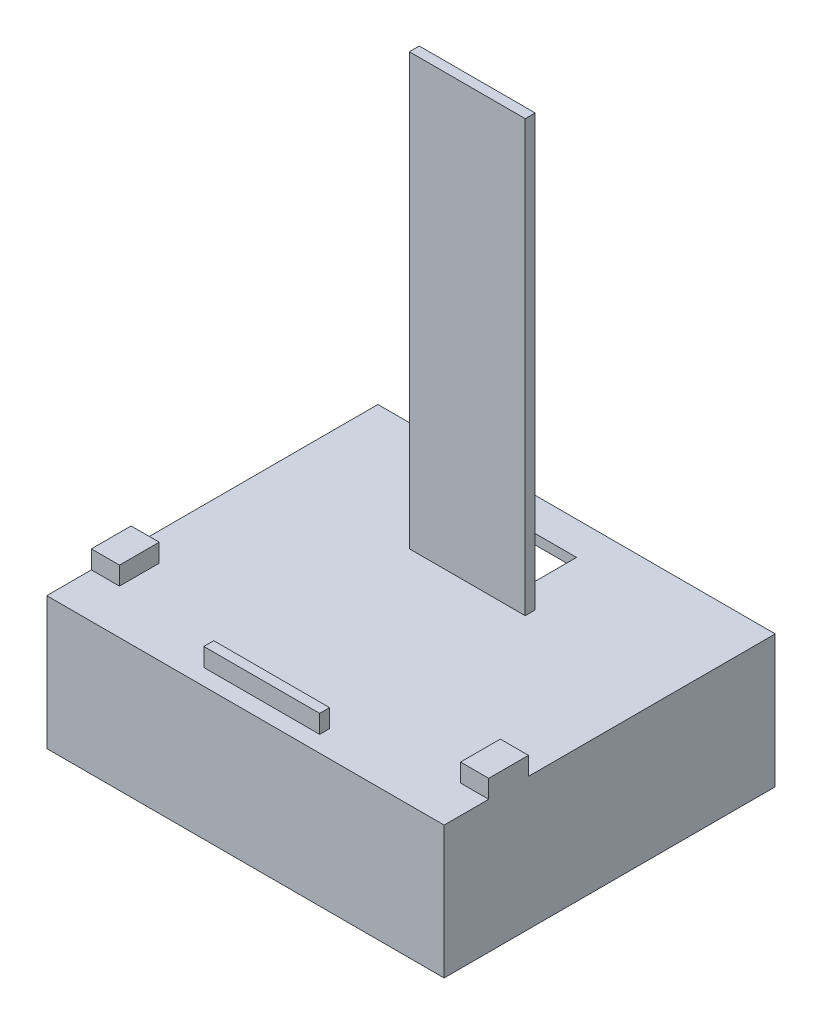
ISO-10303-21;
HEADER;
FILE_DESCRIPTION(('STEP AP214'),'2;1');
FILE_NAME('part.step','',(''),(''),'','','');
FILE_SCHEMA(('AUTOMOTIVE_DESIGN { 1 0 10303 214 1 1 1 1 }'));
ENDSEC;
DATA;
#1=APPLICATION_CONTEXT('core data for automotive mechanical design processes');
#2=APPLICATION_PROTOCOL_DEFINITION('international standard','automotive_design',2000,#1);
#3=PRODUCT_CONTEXT('',#1,'mechanical');
#4=PRODUCT('Part','Part','',(#3));
#5=PRODUCT_RELATED_PRODUCT_CATEGORY('part','',(#4));
#6=PRODUCT_DEFINITION_FORMATION('','',#4);
#7=PRODUCT_DEFINITION_CONTEXT('part definition',#1,'design');
#8=PRODUCT_DEFINITION('design','',#6,#7);
#9=PRODUCT_DEFINITION_SHAPE('','',#8);
#10=(LENGTH_UNIT() NAMED_UNIT(*) SI_UNIT(.MILLI.,.METRE.));
#11=(NAMED_UNIT(*) PLANE_ANGLE_UNIT() SI_UNIT($,.RADIAN.));
#12=(NAMED_UNIT(*) SI_UNIT($,.STERADIAN.) SOLID_ANGLE_UNIT());
#13=UNCERTAINTY_MEASURE_WITH_UNIT(LENGTH_MEASURE(1.E-05),#10,'distance_accuracy_value','');
#14=(GEOMETRIC_REPRESENTATION_CONTEXT(3) GLOBAL_UNCERTAINTY_ASSIGNED_CONTEXT((#13)) GLOBAL_UNIT_ASSIGNED_CONTEXT((#10,
#11,#12)) REPRESENTATION_CONTEXT('',''));
#15=CARTESIAN_POINT('',(0.,0.,0.));
#16=DIRECTION('',(0.,0.,1.));
#17=DIRECTION('',(1.,0.,0.));
#18=AXIS2_PLACEMENT_3D('',#15,#16,#17);
#19=CARTESIAN_POINT('',(0.,40.,0.));
#20=DIRECTION('',(0.,-1.,0.));
#21=DIRECTION('',(0.,0.,-1.));
#22=AXIS2_PLACEMENT_3D('',#19,#20,#21);
#23=PLANE('',#22);
#24=DIRECTION('',(-1.,0.,0.));
#25=VECTOR('',#24,1.);
#26=CARTESIAN_POINT('',(-51.5,40.,24.5331363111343));
#27=LINE('',#26,#25);
#28=CARTESIAN_POINT('',(-51.5,40.,24.5331363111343));
#29=VERTEX_POINT('',#28);
#30=CARTESIAN_POINT('',(-60.,40.,24.5331363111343));
#31=VERTEX_POINT('',#30);
#32=EDGE_CURVE('E281',#29,#31,#27,.T.);
#33=ORIENTED_EDGE('',*,*,#32,.F.);
#34=DIRECTION('',(0.,0.,-1.));
#35=VECTOR('',#34,1.);
#36=CARTESIAN_POINT('',(-51.5,40.,36.5331363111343));
#37=LINE('',#36,#35);
#38=CARTESIAN_POINT('',(-51.5,40.,36.5331363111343));
#39=VERTEX_POINT('',#38);
#40=EDGE_CURVE('E285',#39,#29,#37,.T.);
#41=ORIENTED_EDGE('',*,*,#40,.F.);
#42=DIRECTION('',(1.,0.,0.));
#43=VECTOR('',#42,1.);
#44=CARTESIAN_POINT('',(-60.,40.,36.5331363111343));
#45=LINE('',#44,#43);
#46=CARTESIAN_POINT('',(-60.,40.,36.5331363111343));
#47=VERTEX_POINT('',#46);
#48=EDGE_CURVE('E278',#47,#39,#45,.T.);
#49=ORIENTED_EDGE('',*,*,#48,.F.);
#50=DIRECTION('',(0.,0.,1.));
#51=VECTOR('',#50,1.);
#52=CARTESIAN_POINT('',(-60.,40.,50.));
#53=LINE('',#52,#51);
#54=CARTESIAN_POINT('',(-60.,40.,50.));
#55=VERTEX_POINT('',#54);
#56=EDGE_CURVE('E430',#47,#55,#53,.T.);
#57=ORIENTED_EDGE('',*,*,#56,.T.);
#58=DIRECTION('',(1.,0.,0.));
#59=VECTOR('',#58,1.);
#60=CARTESIAN_POINT('',(-60.,40.,50.));
#61=LINE('',#60,#59);
#62=CARTESIAN_POINT('',(60.,40.,50.));
#63=VERTEX_POINT('',#62);
#64=EDGE_CURVE('E433',#55,#63,#61,.T.);
#65=ORIENTED_EDGE('',*,*,#64,.T.);
#66=DIRECTION('',(0.,0.,-1.));
#67=VECTOR('',#66,1.);
#68=CARTESIAN_POINT('',(60.,40.,50.));
#69=LINE('',#68,#67);
#70=CARTESIAN_POINT('',(60.,40.,36.5331363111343));
#71=VERTEX_POINT('',#70);
#72=EDGE_CURVE('E425',#63,#71,#69,.T.);
#73=ORIENTED_EDGE('',*,*,#72,.T.);
#74=DIRECTION('',(1.,0.,0.));
#75=VECTOR('',#74,1.);
#76=CARTESIAN_POINT('',(60.,40.,36.5331363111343));
#77=LINE('',#76,#75);
#78=CARTESIAN_POINT('',(51.5,40.,36.5331363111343));
#79=VERTEX_POINT('',#78);
#80=EDGE_CURVE('E308',#79,#71,#77,.T.);
#81=ORIENTED_EDGE('',*,*,#80,.F.);
#82=DIRECTION('',(0.,0.,1.));
#83=VECTOR('',#82,1.);
#84=CARTESIAN_POINT('',(51.5,40.,36.5331363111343));
#85=LINE('',#84,#83);
#86=CARTESIAN_POINT('',(51.5,40.,24.5331363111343));
#87=VERTEX_POINT('',#86);
#88=EDGE_CURVE('E311',#87,#79,#85,.T.);
#89=ORIENTED_EDGE('',*,*,#88,.F.);
#90=DIRECTION('',(-1.,0.,0.));
#91=VECTOR('',#90,1.);
#92=CARTESIAN_POINT('',(51.5,40.,24.5331363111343));
#93=LINE('',#92,#91);
#94=CARTESIAN_POINT('',(60.,40.,24.5331363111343));
#95=VERTEX_POINT('',#94);
#96=EDGE_CURVE('E315',#95,#87,#93,.T.);
#97=ORIENTED_EDGE('',*,*,#96,.F.);
#98=CARTESIAN_POINT('',(60.,40.,-50.));
#99=VERTEX_POINT('',#98);
#100=EDGE_CURVE('E428',#95,#99,#69,.T.);
#101=ORIENTED_EDGE('',*,*,#100,.T.);
#102=DIRECTION('',(-1.,0.,0.));
#103=VECTOR('',#102,1.);
#104=CARTESIAN_POINT('',(-60.,40.,-50.));
#105=LINE('',#104,#103);
#106=CARTESIAN_POINT('',(-60.,40.,-50.));
#107=VERTEX_POINT('',#106);
#108=EDGE_CURVE('E427',#99,#107,#105,.T.);
#109=ORIENTED_EDGE('',*,*,#108,.T.);
#110=EDGE_CURVE('E431',#107,#31,#53,.T.);
#111=ORIENTED_EDGE('',*,*,#110,.T.);
#112=EDGE_LOOP('',(#33,#41,#49,#57,#65,#73,#81,#89,#97,#101,#109,#111));
#113=FACE_BOUND('',#112,.T.);
#114=DIRECTION('',(0.,0.,-1.));
#115=VECTOR('',#114,1.);
#116=CARTESIAN_POINT('',(17.5,40.,45.0733400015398));
#117=LINE('',#116,#115);
#118=CARTESIAN_POINT('',(17.5,40.,45.0733400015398));
#119=VERTEX_POINT('',#118);
#120=CARTESIAN_POINT('',(17.5,40.,42.0733400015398));
#121=VERTEX_POINT('',#120);
#122=EDGE_CURVE('E318',#119,#121,#117,.T.);
#123=ORIENTED_EDGE('',*,*,#122,.F.);
#124=DIRECTION('',(1.,0.,0.));
#125=VECTOR('',#124,1.);
#126=CARTESIAN_POINT('',(-17.5,40.,45.0733400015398));
#127=LINE('',#126,#125);
#128=CARTESIAN_POINT('',(-17.5,40.,45.0733400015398));
#129=VERTEX_POINT('',#128);
#130=EDGE_CURVE('E330',#129,#119,#127,.T.);
#131=ORIENTED_EDGE('',*,*,#130,.F.);
#132=DIRECTION('',(0.,0.,1.));
#133=VECTOR('',#132,1.);
#134=CARTESIAN_POINT('',(-17.5,40.,45.0733400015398));
#135=LINE('',#134,#133);
#136=CARTESIAN_POINT('',(-17.5,40.,42.0733400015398));
#137=VERTEX_POINT('',#136);
#138=EDGE_CURVE('E342',#137,#129,#135,.T.);
#139=ORIENTED_EDGE('',*,*,#138,.F.);
#140=DIRECTION('',(-1.,0.,0.));
#141=VECTOR('',#140,1.);
#142=CARTESIAN_POINT('',(-17.5,40.,42.0733400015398));
#143=LINE('',#142,#141);
#144=EDGE_CURVE('E339',#121,#137,#143,.T.);
#145=ORIENTED_EDGE('',*,*,#144,.F.);
#146=EDGE_LOOP('',(#123,#131,#139,#145));
#147=FACE_BOUND('',#146,.T.);
#148=DIRECTION('',(0.,0.,1.));
#149=VECTOR('',#148,1.);
#150=CARTESIAN_POINT('',(10.,40.,0.));
#151=LINE('',#150,#149);
#152=CARTESIAN_POINT('',(10.,40.,-40.));
#153=VERTEX_POINT('',#152);
#154=CARTESIAN_POINT('',(10.,40.,-20.));
#155=VERTEX_POINT('',#154);
#156=EDGE_CURVE('E254',#153,#155,#151,.T.);
#157=ORIENTED_EDGE('',*,*,#156,.T.);
#158=DIRECTION('',(1.,0.,0.));
#159=VECTOR('',#158,1.);
#160=CARTESIAN_POINT('',(-17.5,40.,-20.));
#161=LINE('',#160,#159);
#162=CARTESIAN_POINT('',(17.5,40.,-20.));
#163=VERTEX_POINT('',#162);
#164=EDGE_CURVE('E238',#155,#163,#161,.T.);
#165=ORIENTED_EDGE('',*,*,#164,.T.);
#166=DIRECTION('',(0.,0.,-1.));
#167=VECTOR('',#166,1.);
#168=CARTESIAN_POINT('',(17.5,40.,-17.));
#169=LINE('',#168,#167);
#170=CARTESIAN_POINT('',(17.5,40.,-17.));
#171=VERTEX_POINT('',#170);
#172=EDGE_CURVE('E379',#171,#163,#169,.T.);
#173=ORIENTED_EDGE('',*,*,#172,.F.);
#174=DIRECTION('',(1.,0.,0.));
#175=VECTOR('',#174,1.);
#176=CARTESIAN_POINT('',(-17.5,40.,-17.));
#177=LINE('',#176,#175);
#178=CARTESIAN_POINT('',(-17.5,40.,-17.));
#179=VERTEX_POINT('',#178);
#180=EDGE_CURVE('E363',#179,#171,#177,.T.);
#181=ORIENTED_EDGE('',*,*,#180,.F.);
#182=DIRECTION('',(0.,0.,-1.));
#183=VECTOR('',#182,1.);
#184=CARTESIAN_POINT('',(-17.5,40.,-17.));
#185=LINE('',#184,#183);
#186=CARTESIAN_POINT('',(-17.5,40.,-20.));
#187=VERTEX_POINT('',#186);
#188=EDGE_CURVE('E358',#179,#187,#185,.T.);
#189=ORIENTED_EDGE('',*,*,#188,.T.);
#190=CARTESIAN_POINT('',(-10.,40.,-20.));
#191=VERTEX_POINT('',#190);
#192=EDGE_CURVE('E376',#187,#191,#161,.T.);
#193=ORIENTED_EDGE('',*,*,#192,.T.);
#194=DIRECTION('',(0.,0.,1.));
#195=VECTOR('',#194,1.);
#196=CARTESIAN_POINT('',(-9.99999999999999,40.,0.));
#197=LINE('',#196,#195);
#198=CARTESIAN_POINT('',(-10.,40.,-40.));
#199=VERTEX_POINT('',#198);
#200=EDGE_CURVE('E65',#199,#191,#197,.T.);
#201=ORIENTED_EDGE('',*,*,#200,.F.);
#202=DIRECTION('',(1.,0.,0.));
#203=VECTOR('',#202,1.);
#204=CARTESIAN_POINT('',(0.,40.,-40.));
#205=LINE('',#204,#203);
#206=EDGE_CURVE('E264',#199,#153,#205,.T.);
#207=ORIENTED_EDGE('',*,*,#206,.T.);
#208=EDGE_LOOP('',(#157,#165,#173,#181,#189,#193,#201,#207));
#209=FACE_BOUND('',#208,.T.);
#210=ADVANCED_FACE('F45',(#113,#147,#209),#23,.F.);
#211=CARTESIAN_POINT('',(0.,37.,0.));
#212=DIRECTION('',(0.,-1.,0.));
#213=DIRECTION('',(0.,0.,-1.));
#214=AXIS2_PLACEMENT_3D('',#211,#212,#213);
#215=PLANE('',#214);
#216=DIRECTION('',(0.,0.,-1.));
#217=VECTOR('',#216,1.);
#218=CARTESIAN_POINT('',(57.,37.,0.));
#219=LINE('',#218,#217);
#220=CARTESIAN_POINT('',(57.,37.,47.));
#221=VERTEX_POINT('',#220);
#222=CARTESIAN_POINT('',(57.,37.,-50.));
#223=VERTEX_POINT('',#222);
#224=EDGE_CURVE('E399',#221,#223,#219,.T.);
#225=ORIENTED_EDGE('',*,*,#224,.F.);
#226=DIRECTION('',(1.,0.,0.));
#227=VECTOR('',#226,1.);
#228=CARTESIAN_POINT('',(0.,37.,47.));
#229=LINE('',#228,#227);
#230=CARTESIAN_POINT('',(-57.,37.,47.));
#231=VERTEX_POINT('',#230);
#232=EDGE_CURVE('E407',#231,#221,#229,.T.);
#233=ORIENTED_EDGE('',*,*,#232,.F.);
#234=DIRECTION('',(0.,0.,1.));
#235=VECTOR('',#234,1.);
#236=CARTESIAN_POINT('',(-57.,37.,0.));
#237=LINE('',#236,#235);
#238=CARTESIAN_POINT('',(-57.,37.,-50.));
#239=VERTEX_POINT('',#238);
#240=EDGE_CURVE('E411',#239,#231,#237,.T.);
#241=ORIENTED_EDGE('',*,*,#240,.F.);
#242=DIRECTION('',(-1.,0.,0.));
#243=VECTOR('',#242,1.);
#244=CARTESIAN_POINT('',(0.,37.,-50.));
#245=LINE('',#244,#243);
#246=EDGE_CURVE('E401',#223,#239,#245,.T.);
#247=ORIENTED_EDGE('',*,*,#246,.F.);
#248=EDGE_LOOP('',(#225,#233,#241,#247));
#249=FACE_BOUND('',#248,.T.);
#250=DIRECTION('',(1.,0.,0.));
#251=VECTOR('',#250,1.);
#252=CARTESIAN_POINT('',(0.,37.,-20.));
#253=LINE('',#252,#251);
#254=CARTESIAN_POINT('',(-10.,37.,-20.));
#255=VERTEX_POINT('',#254);
#256=CARTESIAN_POINT('',(10.,37.,-20.));
#257=VERTEX_POINT('',#256);
#258=EDGE_CURVE('E236',#255,#257,#253,.T.);
#259=ORIENTED_EDGE('',*,*,#258,.T.);
#260=DIRECTION('',(0.,0.,1.));
#261=VECTOR('',#260,1.);
#262=CARTESIAN_POINT('',(10.,37.,0.));
#263=LINE('',#262,#261);
#264=CARTESIAN_POINT('',(10.,37.,-40.));
#265=VERTEX_POINT('',#264);
#266=EDGE_CURVE('E244',#265,#257,#263,.T.);
#267=ORIENTED_EDGE('',*,*,#266,.F.);
#268=DIRECTION('',(1.,0.,0.));
#269=VECTOR('',#268,1.);
#270=CARTESIAN_POINT('',(0.,37.,-40.));
#271=LINE('',#270,#269);
#272=CARTESIAN_POINT('',(-10.,37.,-40.));
#273=VERTEX_POINT('',#272);
#274=EDGE_CURVE('E251',#273,#265,#271,.T.);
#275=ORIENTED_EDGE('',*,*,#274,.F.);
#276=DIRECTION('',(0.,0.,1.));
#277=VECTOR('',#276,1.);
#278=CARTESIAN_POINT('',(-9.99999999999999,37.,0.));
#279=LINE('',#278,#277);
#280=EDGE_CURVE('E60',#273,#255,#279,.T.);
#281=ORIENTED_EDGE('',*,*,#280,.T.);
#282=EDGE_LOOP('',(#259,#267,#275,#281));
#283=FACE_BOUND('',#282,.T.);
#284=ADVANCED_FACE('F253',(#249,#283),#215,.T.);
#285=CARTESIAN_POINT('',(-60.,40.,-50.));
#286=DIRECTION('',(0.,0.,1.));
#287=DIRECTION('',(1.,0.,0.));
#288=AXIS2_PLACEMENT_3D('',#285,#286,#287);
#289=PLANE('',#288);
#290=DIRECTION('',(-1.,0.,0.));
#291=VECTOR('',#290,1.);
#292=CARTESIAN_POINT('',(-60.,0.,-50.));
#293=LINE('',#292,#291);
#294=CARTESIAN_POINT('',(60.,0.,-50.));
#295=VERTEX_POINT('',#294);
#296=CARTESIAN_POINT('',(-60.,0.,-50.));
#297=VERTEX_POINT('',#296);
#298=EDGE_CURVE('E438',#295,#297,#293,.T.);
#299=ORIENTED_EDGE('',*,*,#298,.T.);
#300=DIRECTION('',(0.,-1.,0.));
#301=VECTOR('',#300,1.);
#302=CARTESIAN_POINT('',(-60.,40.,-50.));
#303=LINE('',#302,#301);
#304=EDGE_CURVE('E53',#107,#297,#303,.T.);
#305=ORIENTED_EDGE('',*,*,#304,.F.);
#306=ORIENTED_EDGE('',*,*,#108,.F.);
#307=DIRECTION('',(0.,-1.,0.));
#308=VECTOR('',#307,1.);
#309=CARTESIAN_POINT('',(60.,40.,-50.));
#310=LINE('',#309,#308);
#311=EDGE_CURVE('E11',#99,#295,#310,.T.);
#312=ORIENTED_EDGE('',*,*,#311,.T.);
#313=EDGE_LOOP('',(#299,#305,#306,#312));
#314=FACE_BOUND('',#313,.T.);
#315=DIRECTION('',(-1.,0.,0.));
#316=VECTOR('',#315,1.);
#317=CARTESIAN_POINT('',(0.,3.,-50.));
#318=LINE('',#317,#316);
#319=CARTESIAN_POINT('',(57.,3.,-50.));
#320=VERTEX_POINT('',#319);
#321=CARTESIAN_POINT('',(-57.,3.,-50.));
#322=VERTEX_POINT('',#321);
#323=EDGE_CURVE('E398',#320,#322,#318,.T.);
#324=ORIENTED_EDGE('',*,*,#323,.F.);
#325=DIRECTION('',(0.,-1.,0.));
#326=VECTOR('',#325,1.);
#327=CARTESIAN_POINT('',(57.,40.,-50.));
#328=LINE('',#327,#326);
#329=EDGE_CURVE('E417',#223,#320,#328,.T.);
#330=ORIENTED_EDGE('',*,*,#329,.F.);
#331=ORIENTED_EDGE('',*,*,#246,.T.);
#332=DIRECTION('',(0.,-1.,0.));
#333=VECTOR('',#332,1.);
#334=CARTESIAN_POINT('',(-57.,40.,-50.));
#335=LINE('',#334,#333);
#336=EDGE_CURVE('E414',#239,#322,#335,.T.);
#337=ORIENTED_EDGE('',*,*,#336,.T.);
#338=EDGE_LOOP('',(#324,#330,#331,#337));
#339=FACE_BOUND('',#338,.T.);
#340=ADVANCED_FACE('F484',(#314,#339),#289,.F.);
#341=CARTESIAN_POINT('',(60.,40.,50.));
#342=DIRECTION('',(-1.,0.,0.));
#343=DIRECTION('',(0.,0.,1.));
#344=AXIS2_PLACEMENT_3D('',#341,#342,#343);
#345=PLANE('',#344);
#346=DIRECTION('',(0.,0.,-1.));
#347=VECTOR('',#346,1.);
#348=CARTESIAN_POINT('',(60.,0.,50.));
#349=LINE('',#348,#347);
#350=CARTESIAN_POINT('',(60.,0.,50.));
#351=VERTEX_POINT('',#350);
#352=EDGE_CURVE('E419',#351,#295,#349,.T.);
#353=ORIENTED_EDGE('',*,*,#352,.T.);
#354=ORIENTED_EDGE('',*,*,#311,.F.);
#355=ORIENTED_EDGE('',*,*,#100,.F.);
#356=DIRECTION('',(0.,-1.,0.));
#357=VECTOR('',#356,1.);
#358=CARTESIAN_POINT('',(60.,45.5,24.5331363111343));
#359=LINE('',#358,#357);
#360=CARTESIAN_POINT('',(60.,45.5,24.5331363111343));
#361=VERTEX_POINT('',#360);
#362=EDGE_CURVE('E304',#361,#95,#359,.T.);
#363=ORIENTED_EDGE('',*,*,#362,.F.);
#364=DIRECTION('',(0.,0.,-1.));
#365=VECTOR('',#364,1.);
#366=CARTESIAN_POINT('',(60.,45.5,24.5331363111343));
#367=LINE('',#366,#365);
#368=CARTESIAN_POINT('',(60.,45.5,36.5331363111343));
#369=VERTEX_POINT('',#368);
#370=EDGE_CURVE('E307',#369,#361,#367,.T.);
#371=ORIENTED_EDGE('',*,*,#370,.F.);
#372=DIRECTION('',(0.,-1.,0.));
#373=VECTOR('',#372,1.);
#374=CARTESIAN_POINT('',(60.,45.5,36.5331363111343));
#375=LINE('',#374,#373);
#376=EDGE_CURVE('E301',#369,#71,#375,.T.);
#377=ORIENTED_EDGE('',*,*,#376,.T.);
#378=ORIENTED_EDGE('',*,*,#72,.F.);
#379=DIRECTION('',(0.,-1.,0.));
#380=VECTOR('',#379,1.);
#381=CARTESIAN_POINT('',(60.,40.,50.));
#382=LINE('',#381,#380);
#383=EDGE_CURVE('E435',#63,#351,#382,.T.);
#384=ORIENTED_EDGE('',*,*,#383,.T.);
#385=EDGE_LOOP('',(#353,#354,#355,#363,#371,#377,#378,#384));
#386=FACE_BOUND('',#385,.T.);
#387=ADVANCED_FACE('F47',(#386),#345,.F.);
#388=CARTESIAN_POINT('',(-60.,40.,50.));
#389=DIRECTION('',(1.,0.,0.));
#390=DIRECTION('',(0.,0.,-1.));
#391=AXIS2_PLACEMENT_3D('',#388,#389,#390);
#392=PLANE('',#391);
#393=DIRECTION('',(0.,0.,1.));
#394=VECTOR('',#393,1.);
#395=CARTESIAN_POINT('',(-60.,0.,50.));
#396=LINE('',#395,#394);
#397=CARTESIAN_POINT('',(-60.,0.,50.));
#398=VERTEX_POINT('',#397);
#399=EDGE_CURVE('E440',#297,#398,#396,.T.);
#400=ORIENTED_EDGE('',*,*,#399,.T.);
#401=DIRECTION('',(0.,-1.,0.));
#402=VECTOR('',#401,1.);
#403=CARTESIAN_POINT('',(-60.,40.,50.));
#404=LINE('',#403,#402);
#405=EDGE_CURVE('E446',#55,#398,#404,.T.);
#406=ORIENTED_EDGE('',*,*,#405,.F.);
#407=ORIENTED_EDGE('',*,*,#56,.F.);
#408=DIRECTION('',(0.,-1.,0.));
#409=VECTOR('',#408,1.);
#410=CARTESIAN_POINT('',(-60.,45.5,36.5331363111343));
#411=LINE('',#410,#409);
#412=CARTESIAN_POINT('',(-60.,45.5,36.5331363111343));
#413=VERTEX_POINT('',#412);
#414=EDGE_CURVE('E271',#413,#47,#411,.T.);
#415=ORIENTED_EDGE('',*,*,#414,.F.);
#416=DIRECTION('',(0.,0.,1.));
#417=VECTOR('',#416,1.);
#418=CARTESIAN_POINT('',(-60.,45.5,24.5331363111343));
#419=LINE('',#418,#417);
#420=CARTESIAN_POINT('',(-60.,45.5,24.5331363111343));
#421=VERTEX_POINT('',#420);
#422=EDGE_CURVE('E290',#421,#413,#419,.T.);
#423=ORIENTED_EDGE('',*,*,#422,.F.);
#424=DIRECTION('',(0.,-1.,0.));
#425=VECTOR('',#424,1.);
#426=CARTESIAN_POINT('',(-60.,45.5,24.5331363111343));
#427=LINE('',#426,#425);
#428=EDGE_CURVE('E268',#421,#31,#427,.T.);
#429=ORIENTED_EDGE('',*,*,#428,.T.);
#430=ORIENTED_EDGE('',*,*,#110,.F.);
#431=ORIENTED_EDGE('',*,*,#304,.T.);
#432=EDGE_LOOP('',(#400,#406,#407,#415,#423,#429,#430,#431));
#433=FACE_BOUND('',#432,.T.);
#434=ADVANCED_FACE('F453',(#433),#392,.F.);
#435=CARTESIAN_POINT('',(-60.,40.,50.));
#436=DIRECTION('',(0.,0.,-1.));
#437=DIRECTION('',(-1.,0.,0.));
#438=AXIS2_PLACEMENT_3D('',#435,#436,#437);
#439=PLANE('',#438);
#440=DIRECTION('',(1.,0.,0.));
#441=VECTOR('',#440,1.);
#442=CARTESIAN_POINT('',(-60.,0.,50.));
#443=LINE('',#442,#441);
#444=EDGE_CURVE('E442',#398,#351,#443,.T.);
#445=ORIENTED_EDGE('',*,*,#444,.T.);
#446=ORIENTED_EDGE('',*,*,#383,.F.);
#447=ORIENTED_EDGE('',*,*,#64,.F.);
#448=ORIENTED_EDGE('',*,*,#405,.T.);
#449=EDGE_LOOP('',(#445,#446,#447,#448));
#450=FACE_BOUND('',#449,.T.);
#451=ADVANCED_FACE('F463',(#450),#439,.F.);
#452=CARTESIAN_POINT('',(0.,0.,0.));
#453=DIRECTION('',(0.,-1.,0.));
#454=DIRECTION('',(0.,0.,-1.));
#455=AXIS2_PLACEMENT_3D('',#452,#453,#454);
#456=PLANE('',#455);
#457=ORIENTED_EDGE('',*,*,#352,.F.);
#458=ORIENTED_EDGE('',*,*,#444,.F.);
#459=ORIENTED_EDGE('',*,*,#399,.F.);
#460=ORIENTED_EDGE('',*,*,#298,.F.);
#461=EDGE_LOOP('',(#457,#458,#459,#460));
#462=FACE_BOUND('',#461,.T.);
#463=ADVANCED_FACE('F460',(#462),#456,.T.);
#464=CARTESIAN_POINT('',(57.,40.,50.));
#465=DIRECTION('',(-1.,0.,0.));
#466=DIRECTION('',(0.,0.,1.));
#467=AXIS2_PLACEMENT_3D('',#464,#465,#466);
#468=PLANE('',#467);
#469=DIRECTION('',(0.,0.,-1.));
#470=VECTOR('',#469,1.);
#471=CARTESIAN_POINT('',(57.,3.,0.));
#472=LINE('',#471,#470);
#473=CARTESIAN_POINT('',(57.,3.,47.));
#474=VERTEX_POINT('',#473);
#475=EDGE_CURVE('E386',#474,#320,#472,.T.);
#476=ORIENTED_EDGE('',*,*,#475,.F.);
#477=DIRECTION('',(0.,-1.,0.));
#478=VECTOR('',#477,1.);
#479=CARTESIAN_POINT('',(57.,40.,47.));
#480=LINE('',#479,#478);
#481=EDGE_CURVE('E403',#221,#474,#480,.T.);
#482=ORIENTED_EDGE('',*,*,#481,.F.);
#483=ORIENTED_EDGE('',*,*,#224,.T.);
#484=ORIENTED_EDGE('',*,*,#329,.T.);
#485=EDGE_LOOP('',(#476,#482,#483,#484));
#486=FACE_BOUND('',#485,.T.);
#487=ADVANCED_FACE('F522',(#486),#468,.T.);
#488=CARTESIAN_POINT('',(-57.,40.,50.));
#489=DIRECTION('',(1.,0.,0.));
#490=DIRECTION('',(0.,0.,-1.));
#491=AXIS2_PLACEMENT_3D('',#488,#489,#490);
#492=PLANE('',#491);
#493=DIRECTION('',(0.,0.,1.));
#494=VECTOR('',#493,1.);
#495=CARTESIAN_POINT('',(-57.,3.,0.));
#496=LINE('',#495,#494);
#497=CARTESIAN_POINT('',(-57.,3.,47.));
#498=VERTEX_POINT('',#497);
#499=EDGE_CURVE('E409',#322,#498,#496,.T.);
#500=ORIENTED_EDGE('',*,*,#499,.F.);
#501=ORIENTED_EDGE('',*,*,#336,.F.);
#502=ORIENTED_EDGE('',*,*,#240,.T.);
#503=DIRECTION('',(0.,-1.,0.));
#504=VECTOR('',#503,1.);
#505=CARTESIAN_POINT('',(-57.,40.,47.));
#506=LINE('',#505,#504);
#507=EDGE_CURVE('E406',#231,#498,#506,.T.);
#508=ORIENTED_EDGE('',*,*,#507,.T.);
#509=EDGE_LOOP('',(#500,#501,#502,#508));
#510=FACE_BOUND('',#509,.T.);
#511=ADVANCED_FACE('F557',(#510),#492,.T.);
#512=CARTESIAN_POINT('',(-60.,40.,47.));
#513=DIRECTION('',(0.,0.,-1.));
#514=DIRECTION('',(-1.,0.,0.));
#515=AXIS2_PLACEMENT_3D('',#512,#513,#514);
#516=PLANE('',#515);
#517=DIRECTION('',(1.,0.,0.));
#518=VECTOR('',#517,1.);
#519=CARTESIAN_POINT('',(0.,3.,47.));
#520=LINE('',#519,#518);
#521=EDGE_CURVE('E402',#498,#474,#520,.T.);
#522=ORIENTED_EDGE('',*,*,#521,.F.);
#523=ORIENTED_EDGE('',*,*,#507,.F.);
#524=ORIENTED_EDGE('',*,*,#232,.T.);
#525=ORIENTED_EDGE('',*,*,#481,.T.);
#526=EDGE_LOOP('',(#522,#523,#524,#525));
#527=FACE_BOUND('',#526,.T.);
#528=ADVANCED_FACE('F566',(#527),#516,.T.);
#529=CARTESIAN_POINT('',(0.,3.,0.));
#530=DIRECTION('',(0.,-1.,0.));
#531=DIRECTION('',(0.,0.,-1.));
#532=AXIS2_PLACEMENT_3D('',#529,#530,#531);
#533=PLANE('',#532);
#534=ORIENTED_EDGE('',*,*,#475,.T.);
#535=ORIENTED_EDGE('',*,*,#323,.T.);
#536=ORIENTED_EDGE('',*,*,#499,.T.);
#537=ORIENTED_EDGE('',*,*,#521,.T.);
#538=EDGE_LOOP('',(#534,#535,#536,#537));
#539=FACE_BOUND('',#538,.T.);
#540=ADVANCED_FACE('F519',(#539),#533,.F.);
#541=CARTESIAN_POINT('',(-17.5,170.,-17.));
#542=DIRECTION('',(-1.,0.,0.));
#543=DIRECTION('',(0.,0.,1.));
#544=AXIS2_PLACEMENT_3D('',#541,#542,#543);
#545=PLANE('',#544);
#546=ORIENTED_EDGE('',*,*,#188,.F.);
#547=DIRECTION('',(0.,-1.,0.));
#548=VECTOR('',#547,1.);
#549=CARTESIAN_POINT('',(-17.5,170.,-17.));
#550=LINE('',#549,#548);
#551=CARTESIAN_POINT('',(-17.5,170.,-17.));
#552=VERTEX_POINT('',#551);
#553=EDGE_CURVE('E383',#552,#179,#550,.T.);
#554=ORIENTED_EDGE('',*,*,#553,.F.);
#555=DIRECTION('',(0.,0.,-1.));
#556=VECTOR('',#555,1.);
#557=CARTESIAN_POINT('',(-17.5,170.,-17.));
#558=LINE('',#557,#556);
#559=CARTESIAN_POINT('',(-17.5,170.,-20.));
#560=VERTEX_POINT('',#559);
#561=EDGE_CURVE('E359',#552,#560,#558,.T.);
#562=ORIENTED_EDGE('',*,*,#561,.T.);
#563=DIRECTION('',(0.,-1.,0.));
#564=VECTOR('',#563,1.);
#565=CARTESIAN_POINT('',(-17.5,170.,-20.));
#566=LINE('',#565,#564);
#567=EDGE_CURVE('E373',#560,#187,#566,.T.);
#568=ORIENTED_EDGE('',*,*,#567,.T.);
#569=EDGE_LOOP('',(#546,#554,#562,#568));
#570=FACE_BOUND('',#569,.T.);
#571=ADVANCED_FACE('F583',(#570),#545,.T.);
#572=CARTESIAN_POINT('',(-17.5,170.,-17.));
#573=DIRECTION('',(0.,0.,-1.));
#574=DIRECTION('',(-1.,0.,0.));
#575=AXIS2_PLACEMENT_3D('',#572,#573,#574);
#576=PLANE('',#575);
#577=ORIENTED_EDGE('',*,*,#180,.T.);
#578=DIRECTION('',(0.,-1.,0.));
#579=VECTOR('',#578,1.);
#580=CARTESIAN_POINT('',(17.5,170.,-17.));
#581=LINE('',#580,#579);
#582=CARTESIAN_POINT('',(17.5,170.,-17.));
#583=VERTEX_POINT('',#582);
#584=EDGE_CURVE('E387',#583,#171,#581,.T.);
#585=ORIENTED_EDGE('',*,*,#584,.F.);
#586=DIRECTION('',(1.,0.,0.));
#587=VECTOR('',#586,1.);
#588=CARTESIAN_POINT('',(-17.5,170.,-17.));
#589=LINE('',#588,#587);
#590=EDGE_CURVE('E370',#552,#583,#589,.T.);
#591=ORIENTED_EDGE('',*,*,#590,.F.);
#592=ORIENTED_EDGE('',*,*,#553,.T.);
#593=EDGE_LOOP('',(#577,#585,#591,#592));
#594=FACE_BOUND('',#593,.T.);
#595=ADVANCED_FACE('F591',(#594),#576,.F.);
#596=CARTESIAN_POINT('',(17.5,170.,-17.));
#597=DIRECTION('',(-1.,0.,0.));
#598=DIRECTION('',(0.,0.,1.));
#599=AXIS2_PLACEMENT_3D('',#596,#597,#598);
#600=PLANE('',#599);
#601=ORIENTED_EDGE('',*,*,#172,.T.);
#602=DIRECTION('',(0.,-1.,0.));
#603=VECTOR('',#602,1.);
#604=CARTESIAN_POINT('',(17.5,170.,-20.));
#605=LINE('',#604,#603);
#606=CARTESIAN_POINT('',(17.5,170.,-20.));
#607=VERTEX_POINT('',#606);
#608=EDGE_CURVE('E391',#607,#163,#605,.T.);
#609=ORIENTED_EDGE('',*,*,#608,.F.);
#610=DIRECTION('',(0.,0.,-1.));
#611=VECTOR('',#610,1.);
#612=CARTESIAN_POINT('',(17.5,170.,-17.));
#613=LINE('',#612,#611);
#614=EDGE_CURVE('E367',#583,#607,#613,.T.);
#615=ORIENTED_EDGE('',*,*,#614,.F.);
#616=ORIENTED_EDGE('',*,*,#584,.T.);
#617=EDGE_LOOP('',(#601,#609,#615,#616));
#618=FACE_BOUND('',#617,.T.);
#619=ADVANCED_FACE('F600',(#618),#600,.F.);
#620=CARTESIAN_POINT('',(-17.5,170.,-20.));
#621=DIRECTION('',(0.,0.,-1.));
#622=DIRECTION('',(-1.,0.,0.));
#623=AXIS2_PLACEMENT_3D('',#620,#621,#622);
#624=PLANE('',#623);
#625=ORIENTED_EDGE('',*,*,#192,.F.);
#626=ORIENTED_EDGE('',*,*,#567,.F.);
#627=DIRECTION('',(1.,0.,0.));
#628=VECTOR('',#627,1.);
#629=CARTESIAN_POINT('',(-17.5,170.,-20.));
#630=LINE('',#629,#628);
#631=EDGE_CURVE('E362',#560,#607,#630,.T.);
#632=ORIENTED_EDGE('',*,*,#631,.T.);
#633=ORIENTED_EDGE('',*,*,#608,.T.);
#634=ORIENTED_EDGE('',*,*,#164,.F.);
#635=DIRECTION('',(0.,1.,0.));
#636=VECTOR('',#635,1.);
#637=CARTESIAN_POINT('',(10.,8.71572875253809,-20.));
#638=LINE('',#637,#636);
#639=EDGE_CURVE('E231',#257,#155,#638,.T.);
#640=ORIENTED_EDGE('',*,*,#639,.F.);
#641=ORIENTED_EDGE('',*,*,#258,.F.);
#642=DIRECTION('',(0.,1.,0.));
#643=VECTOR('',#642,1.);
#644=CARTESIAN_POINT('',(-10.,8.71572875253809,-20.));
#645=LINE('',#644,#643);
#646=EDGE_CURVE('E260',#255,#191,#645,.T.);
#647=ORIENTED_EDGE('',*,*,#646,.T.);
#648=EDGE_LOOP('',(#625,#626,#632,#633,#634,#640,#641,#647));
#649=FACE_BOUND('',#648,.T.);
#650=ADVANCED_FACE('F234',(#649),#624,.T.);
#651=CARTESIAN_POINT('',(0.,170.,0.));
#652=DIRECTION('',(0.,-1.,0.));
#653=DIRECTION('',(0.,0.,-1.));
#654=AXIS2_PLACEMENT_3D('',#651,#652,#653);
#655=PLANE('',#654);
#656=ORIENTED_EDGE('',*,*,#561,.F.);
#657=ORIENTED_EDGE('',*,*,#590,.T.);
#658=ORIENTED_EDGE('',*,*,#614,.T.);
#659=ORIENTED_EDGE('',*,*,#631,.F.);
#660=EDGE_LOOP('',(#656,#657,#658,#659));
#661=FACE_BOUND('',#660,.T.);
#662=ADVANCED_FACE('F618',(#661),#655,.F.);
#663=CARTESIAN_POINT('',(17.5,45.5,45.0733400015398));
#664=DIRECTION('',(-1.,0.,0.));
#665=DIRECTION('',(0.,0.,1.));
#666=AXIS2_PLACEMENT_3D('',#663,#664,#665);
#667=PLANE('',#666);
#668=ORIENTED_EDGE('',*,*,#122,.T.);
#669=DIRECTION('',(0.,-1.,0.));
#670=VECTOR('',#669,1.);
#671=CARTESIAN_POINT('',(17.5,45.5,42.0733400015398));
#672=LINE('',#671,#670);
#673=CARTESIAN_POINT('',(17.5,45.5,42.0733400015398));
#674=VERTEX_POINT('',#673);
#675=EDGE_CURVE('E355',#674,#121,#672,.T.);
#676=ORIENTED_EDGE('',*,*,#675,.F.);
#677=DIRECTION('',(0.,0.,-1.));
#678=VECTOR('',#677,1.);
#679=CARTESIAN_POINT('',(17.5,45.5,45.0733400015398));
#680=LINE('',#679,#678);
#681=CARTESIAN_POINT('',(17.5,45.5,45.0733400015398));
#682=VERTEX_POINT('',#681);
#683=EDGE_CURVE('E326',#682,#674,#680,.T.);
#684=ORIENTED_EDGE('',*,*,#683,.F.);
#685=DIRECTION('',(0.,-1.,0.));
#686=VECTOR('',#685,1.);
#687=CARTESIAN_POINT('',(17.5,45.5,45.0733400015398));
#688=LINE('',#687,#686);
#689=EDGE_CURVE('E336',#682,#119,#688,.T.);
#690=ORIENTED_EDGE('',*,*,#689,.T.);
#691=EDGE_LOOP('',(#668,#676,#684,#690));
#692=FACE_BOUND('',#691,.T.);
#693=ADVANCED_FACE('F626',(#692),#667,.F.);
#694=CARTESIAN_POINT('',(-17.5,45.5,42.0733400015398));
#695=DIRECTION('',(0.,0.,1.));
#696=DIRECTION('',(1.,0.,0.));
#697=AXIS2_PLACEMENT_3D('',#694,#695,#696);
#698=PLANE('',#697);
#699=ORIENTED_EDGE('',*,*,#144,.T.);
#700=DIRECTION('',(0.,-1.,0.));
#701=VECTOR('',#700,1.);
#702=CARTESIAN_POINT('',(-17.5,45.5,42.0733400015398));
#703=LINE('',#702,#701);
#704=CARTESIAN_POINT('',(-17.5,45.5,42.0733400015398));
#705=VERTEX_POINT('',#704);
#706=EDGE_CURVE('E352',#705,#137,#703,.T.);
#707=ORIENTED_EDGE('',*,*,#706,.F.);
#708=DIRECTION('',(-1.,0.,0.));
#709=VECTOR('',#708,1.);
#710=CARTESIAN_POINT('',(-17.5,45.5,42.0733400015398));
#711=LINE('',#710,#709);
#712=EDGE_CURVE('E329',#674,#705,#711,.T.);
#713=ORIENTED_EDGE('',*,*,#712,.F.);
#714=ORIENTED_EDGE('',*,*,#675,.T.);
#715=EDGE_LOOP('',(#699,#707,#713,#714));
#716=FACE_BOUND('',#715,.T.);
#717=ADVANCED_FACE('F634',(#716),#698,.F.);
#718=CARTESIAN_POINT('',(-17.5,45.5,45.0733400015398));
#719=DIRECTION('',(1.,0.,0.));
#720=DIRECTION('',(0.,0.,-1.));
#721=AXIS2_PLACEMENT_3D('',#718,#719,#720);
#722=PLANE('',#721);
#723=ORIENTED_EDGE('',*,*,#138,.T.);
#724=DIRECTION('',(0.,-1.,0.));
#725=VECTOR('',#724,1.);
#726=CARTESIAN_POINT('',(-17.5,45.5,45.0733400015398));
#727=LINE('',#726,#725);
#728=CARTESIAN_POINT('',(-17.5,45.5,45.0733400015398));
#729=VERTEX_POINT('',#728);
#730=EDGE_CURVE('E349',#729,#129,#727,.T.);
#731=ORIENTED_EDGE('',*,*,#730,.F.);
#732=DIRECTION('',(0.,0.,1.));
#733=VECTOR('',#732,1.);
#734=CARTESIAN_POINT('',(-17.5,45.5,45.0733400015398));
#735=LINE('',#734,#733);
#736=EDGE_CURVE('E332',#705,#729,#735,.T.);
#737=ORIENTED_EDGE('',*,*,#736,.F.);
#738=ORIENTED_EDGE('',*,*,#706,.T.);
#739=EDGE_LOOP('',(#723,#731,#737,#738));
#740=FACE_BOUND('',#739,.T.);
#741=ADVANCED_FACE('F643',(#740),#722,.F.);
#742=CARTESIAN_POINT('',(-17.5,45.5,45.0733400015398));
#743=DIRECTION('',(0.,0.,-1.));
#744=DIRECTION('',(-1.,0.,0.));
#745=AXIS2_PLACEMENT_3D('',#742,#743,#744);
#746=PLANE('',#745);
#747=ORIENTED_EDGE('',*,*,#130,.T.);
#748=ORIENTED_EDGE('',*,*,#689,.F.);
#749=DIRECTION('',(1.,0.,0.));
#750=VECTOR('',#749,1.);
#751=CARTESIAN_POINT('',(-17.5,45.5,45.0733400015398));
#752=LINE('',#751,#750);
#753=EDGE_CURVE('E334',#729,#682,#752,.T.);
#754=ORIENTED_EDGE('',*,*,#753,.F.);
#755=ORIENTED_EDGE('',*,*,#730,.T.);
#756=EDGE_LOOP('',(#747,#748,#754,#755));
#757=FACE_BOUND('',#756,.T.);
#758=ADVANCED_FACE('F652',(#757),#746,.F.);
#759=CARTESIAN_POINT('',(0.,45.5,0.));
#760=DIRECTION('',(0.,-1.,0.));
#761=DIRECTION('',(0.,0.,-1.));
#762=AXIS2_PLACEMENT_3D('',#759,#760,#761);
#763=PLANE('',#762);
#764=ORIENTED_EDGE('',*,*,#683,.T.);
#765=ORIENTED_EDGE('',*,*,#712,.T.);
#766=ORIENTED_EDGE('',*,*,#736,.T.);
#767=ORIENTED_EDGE('',*,*,#753,.T.);
#768=EDGE_LOOP('',(#764,#765,#766,#767));
#769=FACE_BOUND('',#768,.T.);
#770=ADVANCED_FACE('F661',(#769),#763,.F.);
#771=CARTESIAN_POINT('',(51.5,45.5,24.5331363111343));
#772=DIRECTION('',(0.,0.,1.));
#773=DIRECTION('',(1.,0.,0.));
#774=AXIS2_PLACEMENT_3D('',#771,#772,#773);
#775=PLANE('',#774);
#776=ORIENTED_EDGE('',*,*,#96,.T.);
#777=DIRECTION('',(0.,-1.,0.));
#778=VECTOR('',#777,1.);
#779=CARTESIAN_POINT('',(51.5,45.5,24.5331363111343));
#780=LINE('',#779,#778);
#781=CARTESIAN_POINT('',(51.5,45.5,24.5331363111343));
#782=VERTEX_POINT('',#781);
#783=EDGE_CURVE('E288',#782,#87,#780,.T.);
#784=ORIENTED_EDGE('',*,*,#783,.F.);
#785=DIRECTION('',(-1.,0.,0.));
#786=VECTOR('',#785,1.);
#787=CARTESIAN_POINT('',(51.5,45.5,24.5331363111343));
#788=LINE('',#787,#786);
#789=EDGE_CURVE('E312',#361,#782,#788,.T.);
#790=ORIENTED_EDGE('',*,*,#789,.F.);
#791=ORIENTED_EDGE('',*,*,#362,.T.);
#792=EDGE_LOOP('',(#776,#784,#790,#791));
#793=FACE_BOUND('',#792,.T.);
#794=ADVANCED_FACE('F483',(#793),#775,.F.);
#795=CARTESIAN_POINT('',(51.5,45.5,36.5331363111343));
#796=DIRECTION('',(1.,0.,0.));
#797=DIRECTION('',(0.,0.,-1.));
#798=AXIS2_PLACEMENT_3D('',#795,#796,#797);
#799=PLANE('',#798);
#800=ORIENTED_EDGE('',*,*,#88,.T.);
#801=DIRECTION('',(0.,-1.,0.));
#802=VECTOR('',#801,1.);
#803=CARTESIAN_POINT('',(51.5,45.5,36.5331363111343));
#804=LINE('',#803,#802);
#805=CARTESIAN_POINT('',(51.5,45.5,36.5331363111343));
#806=VERTEX_POINT('',#805);
#807=EDGE_CURVE('E298',#806,#79,#804,.T.);
#808=ORIENTED_EDGE('',*,*,#807,.F.);
#809=DIRECTION('',(0.,0.,1.));
#810=VECTOR('',#809,1.);
#811=CARTESIAN_POINT('',(51.5,45.5,36.5331363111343));
#812=LINE('',#811,#810);
#813=EDGE_CURVE('E322',#782,#806,#812,.T.);
#814=ORIENTED_EDGE('',*,*,#813,.F.);
#815=ORIENTED_EDGE('',*,*,#783,.T.);
#816=EDGE_LOOP('',(#800,#808,#814,#815));
#817=FACE_BOUND('',#816,.T.);
#818=ADVANCED_FACE('F477',(#817),#799,.F.);
#819=CARTESIAN_POINT('',(60.,45.5,36.5331363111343));
#820=DIRECTION('',(0.,0.,-1.));
#821=DIRECTION('',(-1.,0.,0.));
#822=AXIS2_PLACEMENT_3D('',#819,#820,#821);
#823=PLANE('',#822);
#824=ORIENTED_EDGE('',*,*,#80,.T.);
#825=ORIENTED_EDGE('',*,*,#376,.F.);
#826=DIRECTION('',(1.,0.,0.));
#827=VECTOR('',#826,1.);
#828=CARTESIAN_POINT('',(60.,45.5,36.5331363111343));
#829=LINE('',#828,#827);
#830=EDGE_CURVE('E320',#806,#369,#829,.T.);
#831=ORIENTED_EDGE('',*,*,#830,.F.);
#832=ORIENTED_EDGE('',*,*,#807,.T.);
#833=EDGE_LOOP('',(#824,#825,#831,#832));
#834=FACE_BOUND('',#833,.T.);
#835=ADVANCED_FACE('F473',(#834),#823,.F.);
#836=CARTESIAN_POINT('',(0.,45.5,0.));
#837=DIRECTION('',(0.,-1.,0.));
#838=DIRECTION('',(0.,0.,-1.));
#839=AXIS2_PLACEMENT_3D('',#836,#837,#838);
#840=PLANE('',#839);
#841=ORIENTED_EDGE('',*,*,#789,.T.);
#842=ORIENTED_EDGE('',*,*,#813,.T.);
#843=ORIENTED_EDGE('',*,*,#830,.T.);
#844=ORIENTED_EDGE('',*,*,#370,.T.);
#845=EDGE_LOOP('',(#841,#842,#843,#844));
#846=FACE_BOUND('',#845,.T.);
#847=ADVANCED_FACE('F692',(#846),#840,.F.);
#848=CARTESIAN_POINT('',(-51.5,45.5,36.5331363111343));
#849=DIRECTION('',(-1.,0.,0.));
#850=DIRECTION('',(0.,0.,1.));
#851=AXIS2_PLACEMENT_3D('',#848,#849,#850);
#852=PLANE('',#851);
#853=ORIENTED_EDGE('',*,*,#40,.T.);
#854=DIRECTION('',(0.,-1.,0.));
#855=VECTOR('',#854,1.);
#856=CARTESIAN_POINT('',(-51.5,45.5,24.5331363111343));
#857=LINE('',#856,#855);
#858=CARTESIAN_POINT('',(-51.5,45.5,24.5331363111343));
#859=VERTEX_POINT('',#858);
#860=EDGE_CURVE('E250',#859,#29,#857,.T.);
#861=ORIENTED_EDGE('',*,*,#860,.F.);
#862=DIRECTION('',(0.,0.,-1.));
#863=VECTOR('',#862,1.);
#864=CARTESIAN_POINT('',(-51.5,45.5,36.5331363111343));
#865=LINE('',#864,#863);
#866=CARTESIAN_POINT('',(-51.5,45.5,36.5331363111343));
#867=VERTEX_POINT('',#866);
#868=EDGE_CURVE('E282',#867,#859,#865,.T.);
#869=ORIENTED_EDGE('',*,*,#868,.F.);
#870=DIRECTION('',(0.,-1.,0.));
#871=VECTOR('',#870,1.);
#872=CARTESIAN_POINT('',(-51.5,45.5,36.5331363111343));
#873=LINE('',#872,#871);
#874=EDGE_CURVE('E274',#867,#39,#873,.T.);
#875=ORIENTED_EDGE('',*,*,#874,.T.);
#876=EDGE_LOOP('',(#853,#861,#869,#875));
#877=FACE_BOUND('',#876,.T.);
#878=ADVANCED_FACE('F498',(#877),#852,.F.);
#879=CARTESIAN_POINT('',(-51.5,45.5,24.5331363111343));
#880=DIRECTION('',(0.,0.,1.));
#881=DIRECTION('',(1.,0.,0.));
#882=AXIS2_PLACEMENT_3D('',#879,#880,#881);
#883=PLANE('',#882);
#884=ORIENTED_EDGE('',*,*,#32,.T.);
#885=ORIENTED_EDGE('',*,*,#428,.F.);
#886=DIRECTION('',(-1.,0.,0.));
#887=VECTOR('',#886,1.);
#888=CARTESIAN_POINT('',(-51.5,45.5,24.5331363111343));
#889=LINE('',#888,#887);
#890=EDGE_CURVE('E292',#859,#421,#889,.T.);
#891=ORIENTED_EDGE('',*,*,#890,.F.);
#892=ORIENTED_EDGE('',*,*,#860,.T.);
#893=EDGE_LOOP('',(#884,#885,#891,#892));
#894=FACE_BOUND('',#893,.T.);
#895=ADVANCED_FACE('F488',(#894),#883,.F.);
#896=CARTESIAN_POINT('',(-60.,45.5,36.5331363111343));
#897=DIRECTION('',(0.,0.,-1.));
#898=DIRECTION('',(-1.,0.,0.));
#899=AXIS2_PLACEMENT_3D('',#896,#897,#898);
#900=PLANE('',#899);
#901=ORIENTED_EDGE('',*,*,#48,.T.);
#902=ORIENTED_EDGE('',*,*,#874,.F.);
#903=DIRECTION('',(1.,0.,0.));
#904=VECTOR('',#903,1.);
#905=CARTESIAN_POINT('',(-60.,45.5,36.5331363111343));
#906=LINE('',#905,#904);
#907=EDGE_CURVE('E277',#413,#867,#906,.T.);
#908=ORIENTED_EDGE('',*,*,#907,.F.);
#909=ORIENTED_EDGE('',*,*,#414,.T.);
#910=EDGE_LOOP('',(#901,#902,#908,#909));
#911=FACE_BOUND('',#910,.T.);
#912=ADVANCED_FACE('F501',(#911),#900,.F.);
#913=CARTESIAN_POINT('',(0.,45.5,0.));
#914=DIRECTION('',(0.,1.,0.));
#915=DIRECTION('',(0.,0.,1.));
#916=AXIS2_PLACEMENT_3D('',#913,#914,#915);
#917=PLANE('',#916);
#918=ORIENTED_EDGE('',*,*,#868,.T.);
#919=ORIENTED_EDGE('',*,*,#890,.T.);
#920=ORIENTED_EDGE('',*,*,#422,.T.);
#921=ORIENTED_EDGE('',*,*,#907,.T.);
#922=EDGE_LOOP('',(#918,#919,#920,#921));
#923=FACE_BOUND('',#922,.T.);
#924=ADVANCED_FACE('F494',(#923),#917,.T.);
#925=CARTESIAN_POINT('',(10.,8.71572875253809,0.));
#926=DIRECTION('',(-1.,0.,0.));
#927=DIRECTION('',(0.,0.,1.));
#928=AXIS2_PLACEMENT_3D('',#925,#926,#927);
#929=PLANE('',#928);
#930=ORIENTED_EDGE('',*,*,#266,.T.);
#931=ORIENTED_EDGE('',*,*,#639,.T.);
#932=ORIENTED_EDGE('',*,*,#156,.F.);
#933=DIRECTION('',(0.,1.,0.));
#934=VECTOR('',#933,1.);
#935=CARTESIAN_POINT('',(10.,8.71572875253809,-40.));
#936=LINE('',#935,#934);
#937=EDGE_CURVE('E246',#265,#153,#936,.T.);
#938=ORIENTED_EDGE('',*,*,#937,.F.);
#939=EDGE_LOOP('',(#930,#931,#932,#938));
#940=FACE_BOUND('',#939,.T.);
#941=ADVANCED_FACE('F245',(#940),#929,.T.);
#942=CARTESIAN_POINT('',(-9.99999999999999,8.71572875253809,0.));
#943=DIRECTION('',(-1.,0.,0.));
#944=DIRECTION('',(0.,0.,1.));
#945=AXIS2_PLACEMENT_3D('',#942,#943,#944);
#946=PLANE('',#945);
#947=DIRECTION('',(0.,1.,0.));
#948=VECTOR('',#947,1.);
#949=CARTESIAN_POINT('',(-10.,8.71572875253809,-40.));
#950=LINE('',#949,#948);
#951=EDGE_CURVE('E262',#273,#199,#950,.T.);
#952=ORIENTED_EDGE('',*,*,#951,.T.);
#953=ORIENTED_EDGE('',*,*,#200,.T.);
#954=ORIENTED_EDGE('',*,*,#646,.F.);
#955=ORIENTED_EDGE('',*,*,#280,.F.);
#956=EDGE_LOOP('',(#952,#953,#954,#955));
#957=FACE_BOUND('',#956,.T.);
#958=ADVANCED_FACE('F777',(#957),#946,.F.);
#959=CARTESIAN_POINT('',(0.,8.71572875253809,-40.));
#960=DIRECTION('',(0.,0.,1.));
#961=DIRECTION('',(1.,0.,0.));
#962=AXIS2_PLACEMENT_3D('',#959,#960,#961);
#963=PLANE('',#962);
#964=ORIENTED_EDGE('',*,*,#274,.T.);
#965=ORIENTED_EDGE('',*,*,#937,.T.);
#966=ORIENTED_EDGE('',*,*,#206,.F.);
#967=ORIENTED_EDGE('',*,*,#951,.F.);
#968=EDGE_LOOP('',(#964,#965,#966,#967));
#969=FACE_BOUND('',#968,.T.);
#970=ADVANCED_FACE('F785',(#969),#963,.T.);
#971=CLOSED_SHELL('',(#210,#284,#340,#387,#434,#451,#463,#487,#511,#528,#540,#571,#595,#619,
#650,#662,#693,#717,#741,#758,#770,#794,#818,#835,#847,#878,#895,#912,#924,#941,#958,#970));
#972=MANIFOLD_SOLID_BREP('B2',#971);
#973=ADVANCED_BREP_SHAPE_REPRESENTATION('',(#18,#972),#14);
#974=SHAPE_DEFINITION_REPRESENTATION(#9,#973);
ENDSEC;
END-ISO-10303-21;
